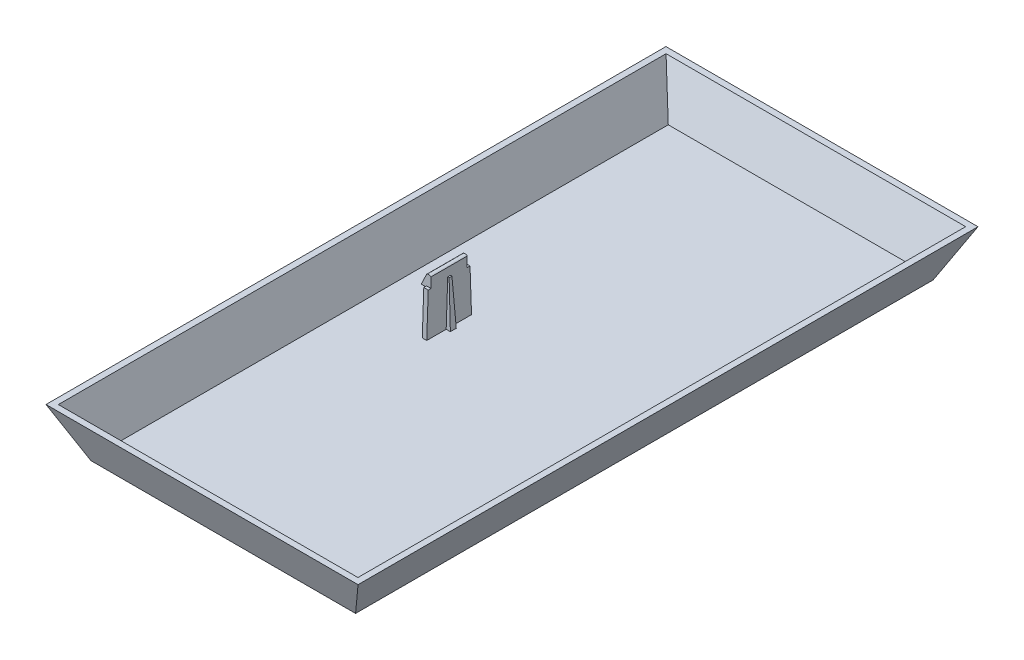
ISO-10303-21;
HEADER;
FILE_DESCRIPTION(('STEP AP214'),'2;1');
FILE_NAME('part.step','',(''),(''),'','','');
FILE_SCHEMA(('AUTOMOTIVE_DESIGN { 1 0 10303 214 1 1 1 1 }'));
ENDSEC;
DATA;
#1=APPLICATION_CONTEXT('core data for automotive mechanical design processes');
#2=APPLICATION_PROTOCOL_DEFINITION('international standard','automotive_design',2000,#1);
#3=PRODUCT_CONTEXT('',#1,'mechanical');
#4=PRODUCT('Part','Part','',(#3));
#5=PRODUCT_RELATED_PRODUCT_CATEGORY('part','',(#4));
#6=PRODUCT_DEFINITION_FORMATION('','',#4);
#7=PRODUCT_DEFINITION_CONTEXT('part definition',#1,'design');
#8=PRODUCT_DEFINITION('design','',#6,#7);
#9=PRODUCT_DEFINITION_SHAPE('','',#8);
#10=(LENGTH_UNIT() NAMED_UNIT(*) SI_UNIT(.MILLI.,.METRE.));
#11=(NAMED_UNIT(*) PLANE_ANGLE_UNIT() SI_UNIT($,.RADIAN.));
#12=(NAMED_UNIT(*) SI_UNIT($,.STERADIAN.) SOLID_ANGLE_UNIT());
#13=UNCERTAINTY_MEASURE_WITH_UNIT(LENGTH_MEASURE(1.E-05),#10,'distance_accuracy_value','');
#14=(GEOMETRIC_REPRESENTATION_CONTEXT(3) GLOBAL_UNCERTAINTY_ASSIGNED_CONTEXT((#13)) GLOBAL_UNIT_ASSIGNED_CONTEXT((#10,
#11,#12)) REPRESENTATION_CONTEXT('',''));
#15=CARTESIAN_POINT('',(0.,0.,0.));
#16=DIRECTION('',(0.,0.,1.));
#17=DIRECTION('',(1.,0.,0.));
#18=AXIS2_PLACEMENT_3D('',#15,#16,#17);
#19=CARTESIAN_POINT('',(-47.5,-15.,222.5));
#20=DIRECTION('',(0.,1.,0.));
#21=DIRECTION('',(0.,0.,1.));
#22=AXIS2_PLACEMENT_3D('',#19,#20,#21);
#23=PLANE('',#22);
#24=DIRECTION('',(-1.,0.,0.));
#25=VECTOR('',#24,1.);
#26=CARTESIAN_POINT('',(-47.5,-15.,8.90080269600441));
#27=LINE('',#26,#25);
#28=CARTESIAN_POINT('',(46.2639320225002,-15.,8.90080269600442));
#29=VERTEX_POINT('',#28);
#30=CARTESIAN_POINT('',(-46.2639320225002,-15.,8.90080269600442));
#31=VERTEX_POINT('',#30);
#32=EDGE_CURVE('E375',#29,#31,#27,.T.);
#33=ORIENTED_EDGE('',*,*,#32,.T.);
#34=DIRECTION('',(0.,0.,-1.));
#35=VECTOR('',#34,1.);
#36=CARTESIAN_POINT('',(-46.2639320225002,-15.,222.5));
#37=LINE('',#36,#35);
#38=CARTESIAN_POINT('',(-46.2639320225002,-15.,213.599197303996));
#39=VERTEX_POINT('',#38);
#40=EDGE_CURVE('E376',#39,#31,#37,.T.);
#41=ORIENTED_EDGE('',*,*,#40,.F.);
#42=DIRECTION('',(-1.,0.,0.));
#43=VECTOR('',#42,1.);
#44=CARTESIAN_POINT('',(-47.5,-15.,213.599197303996));
#45=LINE('',#44,#43);
#46=CARTESIAN_POINT('',(46.2639320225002,-15.,213.599197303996));
#47=VERTEX_POINT('',#46);
#48=EDGE_CURVE('E385',#47,#39,#45,.T.);
#49=ORIENTED_EDGE('',*,*,#48,.F.);
#50=DIRECTION('',(0.,0.,-1.));
#51=VECTOR('',#50,1.);
#52=CARTESIAN_POINT('',(46.2639320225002,-15.,222.5));
#53=LINE('',#52,#51);
#54=EDGE_CURVE('E380',#47,#29,#53,.T.);
#55=ORIENTED_EDGE('',*,*,#54,.T.);
#56=EDGE_LOOP('',(#33,#41,#49,#55));
#57=FACE_BOUND('',#56,.T.);
#58=DIRECTION('',(0.,0.,1.));
#59=VECTOR('',#58,1.);
#60=CARTESIAN_POINT('',(-25.6639320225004,-15.,110.75));
#61=LINE('',#60,#59);
#62=CARTESIAN_POINT('',(-25.6639320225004,-15.,110.191267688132));
#63=VERTEX_POINT('',#62);
#64=CARTESIAN_POINT('',(-25.6639320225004,-15.,112.308732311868));
#65=VERTEX_POINT('',#64);
#66=EDGE_CURVE('E275',#63,#65,#61,.T.);
#67=ORIENTED_EDGE('',*,*,#66,.F.);
#68=DIRECTION('',(1.,0.,0.));
#69=VECTOR('',#68,1.);
#70=CARTESIAN_POINT('',(-24.6639320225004,-15.,110.191267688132));
#71=LINE('',#70,#69);
#72=CARTESIAN_POINT('',(-24.1639320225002,-15.,110.191267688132));
#73=VERTEX_POINT('',#72);
#74=EDGE_CURVE('E75',#73,#63,#71,.F.);
#75=ORIENTED_EDGE('',*,*,#74,.F.);
#76=DIRECTION('',(0.,0.,1.));
#77=VECTOR('',#76,1.);
#78=CARTESIAN_POINT('',(-24.1639320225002,-15.,103.75));
#79=LINE('',#78,#77);
#80=CARTESIAN_POINT('',(-24.1639320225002,-15.,103.212220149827));
#81=VERTEX_POINT('',#80);
#82=EDGE_CURVE('E246',#81,#73,#79,.T.);
#83=ORIENTED_EDGE('',*,*,#82,.F.);
#84=DIRECTION('',(1.,0.,0.));
#85=VECTOR('',#84,1.);
#86=CARTESIAN_POINT('',(-24.1639320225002,-15.,103.212220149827));
#87=LINE('',#86,#85);
#88=CARTESIAN_POINT('',(-22.5639320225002,-15.,103.212220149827));
#89=VERTEX_POINT('',#88);
#90=EDGE_CURVE('E371',#89,#81,#87,.F.);
#91=ORIENTED_EDGE('',*,*,#90,.F.);
#92=DIRECTION('',(0.,0.,-1.));
#93=VECTOR('',#92,1.);
#94=CARTESIAN_POINT('',(-22.5639320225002,-15.,103.75));
#95=LINE('',#94,#93);
#96=CARTESIAN_POINT('',(-22.5639320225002,-15.,110.191267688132));
#97=VERTEX_POINT('',#96);
#98=EDGE_CURVE('E259',#97,#89,#95,.T.);
#99=ORIENTED_EDGE('',*,*,#98,.F.);
#100=DIRECTION('',(-1.,0.,0.));
#101=VECTOR('',#100,1.);
#102=CARTESIAN_POINT('',(-47.5,-15.,110.191267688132));
#103=LINE('',#102,#101);
#104=CARTESIAN_POINT('',(-21.0639320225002,-15.,110.191267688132));
#105=VERTEX_POINT('',#104);
#106=EDGE_CURVE('E451',#97,#105,#103,.F.);
#107=ORIENTED_EDGE('',*,*,#106,.T.);
#108=DIRECTION('',(0.,0.,1.));
#109=VECTOR('',#108,1.);
#110=CARTESIAN_POINT('',(-21.0639320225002,-15.,110.75));
#111=LINE('',#110,#109);
#112=CARTESIAN_POINT('',(-21.0639320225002,-15.,112.308732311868));
#113=VERTEX_POINT('',#112);
#114=EDGE_CURVE('E296',#105,#113,#111,.T.);
#115=ORIENTED_EDGE('',*,*,#114,.T.);
#116=DIRECTION('',(1.,0.,0.));
#117=VECTOR('',#116,1.);
#118=CARTESIAN_POINT('',(-47.5,-15.,112.308732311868));
#119=LINE('',#118,#117);
#120=CARTESIAN_POINT('',(-22.5639320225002,-15.,112.308732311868));
#121=VERTEX_POINT('',#120);
#122=EDGE_CURVE('E445',#121,#113,#119,.T.);
#123=ORIENTED_EDGE('',*,*,#122,.F.);
#124=CARTESIAN_POINT('',(-22.5639320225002,-15.,119.287779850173));
#125=VERTEX_POINT('',#124);
#126=EDGE_CURVE('E258',#125,#121,#95,.T.);
#127=ORIENTED_EDGE('',*,*,#126,.F.);
#128=DIRECTION('',(-1.,0.,0.));
#129=VECTOR('',#128,1.);
#130=CARTESIAN_POINT('',(-24.1639320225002,-15.,119.287779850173));
#131=LINE('',#130,#129);
#132=CARTESIAN_POINT('',(-24.1639320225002,-15.,119.287779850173));
#133=VERTEX_POINT('',#132);
#134=EDGE_CURVE('E252',#133,#125,#131,.F.);
#135=ORIENTED_EDGE('',*,*,#134,.F.);
#136=CARTESIAN_POINT('',(-24.1639320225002,-15.,112.308732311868));
#137=VERTEX_POINT('',#136);
#138=EDGE_CURVE('E236',#137,#133,#79,.T.);
#139=ORIENTED_EDGE('',*,*,#138,.F.);
#140=DIRECTION('',(-1.,0.,0.));
#141=VECTOR('',#140,1.);
#142=CARTESIAN_POINT('',(-24.6639320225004,-15.,112.308732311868));
#143=LINE('',#142,#141);
#144=EDGE_CURVE('E55',#137,#65,#143,.T.);
#145=ORIENTED_EDGE('',*,*,#144,.T.);
#146=EDGE_LOOP('',(#67,#75,#83,#91,#99,#107,#115,#123,#127,#135,#139,#145));
#147=FACE_BOUND('',#146,.T.);
#148=ADVANCED_FACE('F36',(#57,#147),#23,.T.);
#149=CARTESIAN_POINT('',(-24.1639320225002,3.99999999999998,103.75));
#150=DIRECTION('',(1.,0.,0.));
#151=DIRECTION('',(0.,0.,-1.));
#152=AXIS2_PLACEMENT_3D('',#149,#150,#151);
#153=PLANE('',#152);
#154=DIRECTION('',(0.,0.999390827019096,0.034899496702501));
#155=VECTOR('',#154,1.);
#156=CARTESIAN_POINT('',(-24.1639320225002,3.75219841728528,110.846108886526));
#157=LINE('',#156,#155);
#158=CARTESIAN_POINT('',(-24.1639320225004,0.999999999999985,110.75));
#159=VERTEX_POINT('',#158);
#160=EDGE_CURVE('E40',#159,#73,#157,.F.);
#161=ORIENTED_EDGE('',*,*,#160,.F.);
#162=DIRECTION('',(0.,0.,1.));
#163=VECTOR('',#162,1.);
#164=CARTESIAN_POINT('',(-24.1639320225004,0.999999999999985,110.75));
#165=LINE('',#164,#163);
#166=CARTESIAN_POINT('',(-24.1639320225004,0.999999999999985,111.75));
#167=VERTEX_POINT('',#166);
#168=EDGE_CURVE('E280',#159,#167,#165,.T.);
#169=ORIENTED_EDGE('',*,*,#168,.T.);
#170=DIRECTION('',(0.,-0.999390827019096,0.034899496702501));
#171=VECTOR('',#170,1.);
#172=CARTESIAN_POINT('',(-24.1639320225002,4.27537197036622,111.635621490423));
#173=LINE('',#172,#171);
#174=EDGE_CURVE('E243',#167,#137,#173,.T.);
#175=ORIENTED_EDGE('',*,*,#174,.T.);
#176=ORIENTED_EDGE('',*,*,#138,.T.);
#177=DIRECTION('',(0.,0.999390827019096,-0.034899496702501));
#178=VECTOR('',#177,1.);
#179=CARTESIAN_POINT('',(-24.1639320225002,0.399999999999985,118.75));
#180=LINE('',#179,#178);
#181=CARTESIAN_POINT('',(-24.1639320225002,0.399999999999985,118.75));
#182=VERTEX_POINT('',#181);
#183=EDGE_CURVE('E240',#182,#133,#180,.F.);
#184=ORIENTED_EDGE('',*,*,#183,.F.);
#185=DIRECTION('',(0.,0.,-1.));
#186=VECTOR('',#185,1.);
#187=CARTESIAN_POINT('',(-24.1639320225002,0.399999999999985,117.75));
#188=LINE('',#187,#186);
#189=CARTESIAN_POINT('',(-24.1639320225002,0.399999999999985,117.75));
#190=VERTEX_POINT('',#189);
#191=EDGE_CURVE('E344',#182,#190,#188,.T.);
#192=ORIENTED_EDGE('',*,*,#191,.T.);
#193=DIRECTION('',(0.,-1.,0.));
#194=VECTOR('',#193,1.);
#195=CARTESIAN_POINT('',(-24.1639320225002,3.99999999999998,117.75));
#196=LINE('',#195,#194);
#197=CARTESIAN_POINT('',(-24.1639320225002,0.,117.75));
#198=VERTEX_POINT('',#197);
#199=EDGE_CURVE('E341',#190,#198,#196,.T.);
#200=ORIENTED_EDGE('',*,*,#199,.T.);
#201=DIRECTION('',(0.,0.,1.));
#202=VECTOR('',#201,1.);
#203=CARTESIAN_POINT('',(-24.1639320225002,0.,99.3216820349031));
#204=LINE('',#203,#202);
#205=CARTESIAN_POINT('',(-24.1639320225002,0.,113.75));
#206=VERTEX_POINT('',#205);
#207=EDGE_CURVE('E359',#206,#198,#204,.T.);
#208=ORIENTED_EDGE('',*,*,#207,.F.);
#209=DIRECTION('',(0.,1.,0.));
#210=VECTOR('',#209,1.);
#211=CARTESIAN_POINT('',(-24.1639320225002,-4.00000000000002,113.75));
#212=LINE('',#211,#210);
#213=CARTESIAN_POINT('',(-24.1639320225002,3.99999999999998,113.75));
#214=VERTEX_POINT('',#213);
#215=EDGE_CURVE('E310',#206,#214,#212,.T.);
#216=ORIENTED_EDGE('',*,*,#215,.T.);
#217=DIRECTION('',(0.,0.,-1.));
#218=VECTOR('',#217,1.);
#219=CARTESIAN_POINT('',(-24.1639320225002,3.99999999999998,113.75));
#220=LINE('',#219,#218);
#221=CARTESIAN_POINT('',(-24.1639320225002,3.99999999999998,108.75));
#222=VERTEX_POINT('',#221);
#223=EDGE_CURVE('E305',#214,#222,#220,.T.);
#224=ORIENTED_EDGE('',*,*,#223,.T.);
#225=DIRECTION('',(0.,1.,0.));
#226=VECTOR('',#225,1.);
#227=CARTESIAN_POINT('',(-24.1639320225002,-4.00000000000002,108.75));
#228=LINE('',#227,#226);
#229=CARTESIAN_POINT('',(-24.1639320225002,0.,108.75));
#230=VERTEX_POINT('',#229);
#231=EDGE_CURVE('E311',#230,#222,#228,.T.);
#232=ORIENTED_EDGE('',*,*,#231,.F.);
#233=CARTESIAN_POINT('',(-24.1639320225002,0.,104.75));
#234=VERTEX_POINT('',#233);
#235=EDGE_CURVE('E247',#234,#230,#204,.T.);
#236=ORIENTED_EDGE('',*,*,#235,.F.);
#237=DIRECTION('',(0.,-1.,0.));
#238=VECTOR('',#237,1.);
#239=CARTESIAN_POINT('',(-24.1639320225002,3.99999999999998,104.75));
#240=LINE('',#239,#238);
#241=CARTESIAN_POINT('',(-24.1639320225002,0.399999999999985,104.75));
#242=VERTEX_POINT('',#241);
#243=EDGE_CURVE('E323',#242,#234,#240,.T.);
#244=ORIENTED_EDGE('',*,*,#243,.F.);
#245=DIRECTION('',(0.,0.,1.));
#246=VECTOR('',#245,1.);
#247=CARTESIAN_POINT('',(-24.1639320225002,0.399999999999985,104.75));
#248=LINE('',#247,#246);
#249=CARTESIAN_POINT('',(-24.1639320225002,0.399999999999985,103.75));
#250=VERTEX_POINT('',#249);
#251=EDGE_CURVE('E328',#250,#242,#248,.T.);
#252=ORIENTED_EDGE('',*,*,#251,.F.);
#253=DIRECTION('',(0.,0.999390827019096,0.034899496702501));
#254=VECTOR('',#253,1.);
#255=CARTESIAN_POINT('',(-24.1639320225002,3.99561529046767,103.875561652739));
#256=LINE('',#255,#254);
#257=EDGE_CURVE('E369',#250,#81,#256,.F.);
#258=ORIENTED_EDGE('',*,*,#257,.T.);
#259=ORIENTED_EDGE('',*,*,#82,.T.);
#260=EDGE_LOOP('',(#161,#169,#175,#176,#184,#192,#200,#208,#216,#224,#232,#236,#244,#252,#258,#259));
#261=FACE_BOUND('',#260,.T.);
#262=ADVANCED_FACE('F239',(#261),#153,.F.);
#263=CARTESIAN_POINT('',(-22.5639320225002,3.99999999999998,103.75));
#264=DIRECTION('',(-1.,0.,0.));
#265=DIRECTION('',(0.,0.,1.));
#266=AXIS2_PLACEMENT_3D('',#263,#264,#265);
#267=PLANE('',#266);
#268=DIRECTION('',(0.,0.999390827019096,0.034899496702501));
#269=VECTOR('',#268,1.);
#270=CARTESIAN_POINT('',(-22.5639320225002,0.999999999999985,110.75));
#271=LINE('',#270,#269);
#272=CARTESIAN_POINT('',(-22.5639320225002,0.999999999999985,110.75));
#273=VERTEX_POINT('',#272);
#274=EDGE_CURVE('E291',#273,#97,#271,.F.);
#275=ORIENTED_EDGE('',*,*,#274,.T.);
#276=ORIENTED_EDGE('',*,*,#98,.T.);
#277=DIRECTION('',(0.,0.999390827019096,0.034899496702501));
#278=VECTOR('',#277,1.);
#279=CARTESIAN_POINT('',(-22.5639320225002,0.399999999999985,103.75));
#280=LINE('',#279,#278);
#281=CARTESIAN_POINT('',(-22.5639320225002,0.399999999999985,103.75));
#282=VERTEX_POINT('',#281);
#283=EDGE_CURVE('E438',#282,#89,#280,.F.);
#284=ORIENTED_EDGE('',*,*,#283,.F.);
#285=DIRECTION('',(0.,0.,1.));
#286=VECTOR('',#285,1.);
#287=CARTESIAN_POINT('',(-22.5639320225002,0.399999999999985,103.75));
#288=LINE('',#287,#286);
#289=CARTESIAN_POINT('',(-22.5639320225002,0.399999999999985,104.75));
#290=VERTEX_POINT('',#289);
#291=EDGE_CURVE('E338',#282,#290,#288,.T.);
#292=ORIENTED_EDGE('',*,*,#291,.T.);
#293=DIRECTION('',(0.,-1.,0.));
#294=VECTOR('',#293,1.);
#295=CARTESIAN_POINT('',(-22.5639320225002,3.99999999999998,104.75));
#296=LINE('',#295,#294);
#297=CARTESIAN_POINT('',(-22.5639320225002,3.99999999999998,104.75));
#298=VERTEX_POINT('',#297);
#299=EDGE_CURVE('E334',#298,#290,#296,.T.);
#300=ORIENTED_EDGE('',*,*,#299,.F.);
#301=DIRECTION('',(0.,0.,-1.));
#302=VECTOR('',#301,1.);
#303=CARTESIAN_POINT('',(-22.5639320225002,3.99999999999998,103.75));
#304=LINE('',#303,#302);
#305=CARTESIAN_POINT('',(-22.5639320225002,3.99999999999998,117.75));
#306=VERTEX_POINT('',#305);
#307=EDGE_CURVE('E366',#306,#298,#304,.T.);
#308=ORIENTED_EDGE('',*,*,#307,.F.);
#309=DIRECTION('',(0.,-1.,0.));
#310=VECTOR('',#309,1.);
#311=CARTESIAN_POINT('',(-22.5639320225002,3.99999999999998,117.75));
#312=LINE('',#311,#310);
#313=CARTESIAN_POINT('',(-22.5639320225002,0.399999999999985,117.75));
#314=VERTEX_POINT('',#313);
#315=EDGE_CURVE('E352',#306,#314,#312,.T.);
#316=ORIENTED_EDGE('',*,*,#315,.T.);
#317=DIRECTION('',(0.,0.,1.));
#318=VECTOR('',#317,1.);
#319=CARTESIAN_POINT('',(-22.5639320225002,0.399999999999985,103.75));
#320=LINE('',#319,#318);
#321=CARTESIAN_POINT('',(-22.5639320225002,0.399999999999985,118.75));
#322=VERTEX_POINT('',#321);
#323=EDGE_CURVE('E46',#314,#322,#320,.T.);
#324=ORIENTED_EDGE('',*,*,#323,.T.);
#325=DIRECTION('',(0.,0.999390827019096,-0.034899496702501));
#326=VECTOR('',#325,1.);
#327=CARTESIAN_POINT('',(-22.5639320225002,4.51878884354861,118.606168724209));
#328=LINE('',#327,#326);
#329=EDGE_CURVE('E231',#322,#125,#328,.F.);
#330=ORIENTED_EDGE('',*,*,#329,.T.);
#331=ORIENTED_EDGE('',*,*,#126,.T.);
#332=DIRECTION('',(0.,-0.999390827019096,0.034899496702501));
#333=VECTOR('',#332,1.);
#334=CARTESIAN_POINT('',(-22.5639320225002,0.999999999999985,111.75));
#335=LINE('',#334,#333);
#336=CARTESIAN_POINT('',(-22.5639320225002,0.999999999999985,111.75));
#337=VERTEX_POINT('',#336);
#338=EDGE_CURVE('E287',#337,#121,#335,.T.);
#339=ORIENTED_EDGE('',*,*,#338,.F.);
#340=DIRECTION('',(0.,0.,1.));
#341=VECTOR('',#340,1.);
#342=CARTESIAN_POINT('',(-22.5639320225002,0.999999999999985,110.75));
#343=LINE('',#342,#341);
#344=EDGE_CURVE('E298',#273,#337,#343,.T.);
#345=ORIENTED_EDGE('',*,*,#344,.F.);
#346=EDGE_LOOP('',(#275,#276,#284,#292,#300,#308,#316,#324,#330,#331,#339,#345));
#347=FACE_BOUND('',#346,.T.);
#348=ADVANCED_FACE('F468',(#347),#267,.F.);
#349=CARTESIAN_POINT('',(-24.1639320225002,3.99999999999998,99.3216820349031));
#350=DIRECTION('',(-0.90327750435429,0.429056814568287,0.));
#351=DIRECTION('',(-0.429056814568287,-0.90327750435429,0.));
#352=AXIS2_PLACEMENT_3D('',#349,#350,#351);
#353=PLANE('',#352);
#354=DIRECTION('',(-0.429056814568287,-0.90327750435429,0.));
#355=VECTOR('',#354,1.);
#356=CARTESIAN_POINT('',(-24.1639320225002,3.99999999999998,108.75));
#357=LINE('',#356,#355);
#358=CARTESIAN_POINT('',(-26.0639320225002,0.,108.75));
#359=VERTEX_POINT('',#358);
#360=EDGE_CURVE('E321',#222,#359,#357,.T.);
#361=ORIENTED_EDGE('',*,*,#360,.F.);
#362=DIRECTION('',(0.,0.,1.));
#363=VECTOR('',#362,1.);
#364=CARTESIAN_POINT('',(-24.1639320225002,3.99999999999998,103.75));
#365=LINE('',#364,#363);
#366=CARTESIAN_POINT('',(-24.1639320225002,3.99999999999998,104.75));
#367=VERTEX_POINT('',#366);
#368=EDGE_CURVE('E363',#367,#222,#365,.T.);
#369=ORIENTED_EDGE('',*,*,#368,.F.);
#370=DIRECTION('',(-0.429056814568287,-0.90327750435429,0.));
#371=VECTOR('',#370,1.);
#372=CARTESIAN_POINT('',(-24.1639320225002,3.99999999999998,104.75));
#373=LINE('',#372,#371);
#374=CARTESIAN_POINT('',(-26.0639320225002,0.,104.75));
#375=VERTEX_POINT('',#374);
#376=EDGE_CURVE('E336',#367,#375,#373,.T.);
#377=ORIENTED_EDGE('',*,*,#376,.T.);
#378=DIRECTION('',(0.,0.,1.));
#379=VECTOR('',#378,1.);
#380=CARTESIAN_POINT('',(-26.0639320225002,0.,99.3216820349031));
#381=LINE('',#380,#379);
#382=EDGE_CURVE('E360',#375,#359,#381,.T.);
#383=ORIENTED_EDGE('',*,*,#382,.T.);
#384=EDGE_LOOP('',(#361,#369,#377,#383));
#385=FACE_BOUND('',#384,.T.);
#386=ADVANCED_FACE('F592',(#385),#353,.T.);
#387=CARTESIAN_POINT('',(-26.0639320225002,0.,99.3216820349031));
#388=DIRECTION('',(0.,-1.,0.));
#389=DIRECTION('',(0.,0.,-1.));
#390=AXIS2_PLACEMENT_3D('',#387,#388,#389);
#391=PLANE('',#390);
#392=DIRECTION('',(1.,0.,0.));
#393=VECTOR('',#392,1.);
#394=CARTESIAN_POINT('',(-26.0639320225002,0.,108.75));
#395=LINE('',#394,#393);
#396=EDGE_CURVE('E319',#359,#230,#395,.T.);
#397=ORIENTED_EDGE('',*,*,#396,.F.);
#398=ORIENTED_EDGE('',*,*,#382,.F.);
#399=DIRECTION('',(-1.,0.,0.));
#400=VECTOR('',#399,1.);
#401=CARTESIAN_POINT('',(-26.0639320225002,0.,104.75));
#402=LINE('',#401,#400);
#403=EDGE_CURVE('E325',#234,#375,#402,.T.);
#404=ORIENTED_EDGE('',*,*,#403,.F.);
#405=ORIENTED_EDGE('',*,*,#235,.T.);
#406=EDGE_LOOP('',(#397,#398,#404,#405));
#407=FACE_BOUND('',#406,.T.);
#408=ADVANCED_FACE('F588',(#407),#391,.T.);
#409=DIRECTION('',(0.429056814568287,0.90327750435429,0.));
#410=VECTOR('',#409,1.);
#411=CARTESIAN_POINT('',(-24.1639320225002,3.99999999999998,113.75));
#412=LINE('',#411,#410);
#413=CARTESIAN_POINT('',(-26.0639320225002,0.,113.75));
#414=VERTEX_POINT('',#413);
#415=EDGE_CURVE('E317',#414,#214,#412,.T.);
#416=ORIENTED_EDGE('',*,*,#415,.F.);
#417=CARTESIAN_POINT('',(-26.0639320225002,0.,117.75));
#418=VERTEX_POINT('',#417);
#419=EDGE_CURVE('E356',#414,#418,#381,.T.);
#420=ORIENTED_EDGE('',*,*,#419,.T.);
#421=DIRECTION('',(-0.429056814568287,-0.90327750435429,0.));
#422=VECTOR('',#421,1.);
#423=CARTESIAN_POINT('',(-24.1639320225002,3.99999999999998,117.75));
#424=LINE('',#423,#422);
#425=CARTESIAN_POINT('',(-24.1639320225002,3.99999999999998,117.75));
#426=VERTEX_POINT('',#425);
#427=EDGE_CURVE('E433',#426,#418,#424,.T.);
#428=ORIENTED_EDGE('',*,*,#427,.F.);
#429=EDGE_CURVE('E367',#214,#426,#365,.T.);
#430=ORIENTED_EDGE('',*,*,#429,.F.);
#431=EDGE_LOOP('',(#416,#420,#428,#430));
#432=FACE_BOUND('',#431,.T.);
#433=ADVANCED_FACE('F507',(#432),#353,.T.);
#434=CARTESIAN_POINT('',(-24.1639320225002,0.399999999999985,103.75));
#435=DIRECTION('',(0.,0.034899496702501,-0.999390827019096));
#436=DIRECTION('',(0.,0.999390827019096,0.034899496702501));
#437=AXIS2_PLACEMENT_3D('',#434,#435,#436);
#438=PLANE('',#437);
#439=ORIENTED_EDGE('',*,*,#257,.F.);
#440=DIRECTION('',(1.,0.,0.));
#441=VECTOR('',#440,1.);
#442=CARTESIAN_POINT('',(-24.1639320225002,0.399999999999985,103.75));
#443=LINE('',#442,#441);
#444=EDGE_CURVE('E11',#250,#282,#443,.T.);
#445=ORIENTED_EDGE('',*,*,#444,.T.);
#446=ORIENTED_EDGE('',*,*,#283,.T.);
#447=ORIENTED_EDGE('',*,*,#90,.T.);
#448=EDGE_LOOP('',(#439,#445,#446,#447));
#449=FACE_BOUND('',#448,.T.);
#450=ADVANCED_FACE('F474',(#449),#438,.T.);
#451=CARTESIAN_POINT('',(-24.1639320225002,0.399999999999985,118.75));
#452=DIRECTION('',(0.,0.034899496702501,0.999390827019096));
#453=DIRECTION('',(0.,-0.999390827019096,0.034899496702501));
#454=AXIS2_PLACEMENT_3D('',#451,#452,#453);
#455=PLANE('',#454);
#456=DIRECTION('',(-1.,0.,0.));
#457=VECTOR('',#456,1.);
#458=CARTESIAN_POINT('',(-24.1639320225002,0.399999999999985,118.75));
#459=LINE('',#458,#457);
#460=EDGE_CURVE('E254',#322,#182,#459,.T.);
#461=ORIENTED_EDGE('',*,*,#460,.T.);
#462=ORIENTED_EDGE('',*,*,#183,.T.);
#463=ORIENTED_EDGE('',*,*,#134,.T.);
#464=ORIENTED_EDGE('',*,*,#329,.F.);
#465=EDGE_LOOP('',(#461,#462,#463,#464));
#466=FACE_BOUND('',#465,.T.);
#467=ADVANCED_FACE('F251',(#466),#455,.T.);
#468=DIRECTION('',(-1.,0.,0.));
#469=VECTOR('',#468,1.);
#470=CARTESIAN_POINT('',(-26.0639320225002,0.,113.75));
#471=LINE('',#470,#469);
#472=EDGE_CURVE('E313',#206,#414,#471,.T.);
#473=ORIENTED_EDGE('',*,*,#472,.F.);
#474=ORIENTED_EDGE('',*,*,#207,.T.);
#475=DIRECTION('',(-1.,0.,0.));
#476=VECTOR('',#475,1.);
#477=CARTESIAN_POINT('',(-26.0639320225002,0.,117.75));
#478=LINE('',#477,#476);
#479=EDGE_CURVE('E346',#198,#418,#478,.T.);
#480=ORIENTED_EDGE('',*,*,#479,.T.);
#481=ORIENTED_EDGE('',*,*,#419,.F.);
#482=EDGE_LOOP('',(#473,#474,#480,#481));
#483=FACE_BOUND('',#482,.T.);
#484=ADVANCED_FACE('F503',(#483),#391,.T.);
#485=CARTESIAN_POINT('',(-25.5077569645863,0.399999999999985,117.75));
#486=DIRECTION('',(0.,-1.,0.));
#487=DIRECTION('',(0.,0.,-1.));
#488=AXIS2_PLACEMENT_3D('',#485,#486,#487);
#489=PLANE('',#488);
#490=ORIENTED_EDGE('',*,*,#191,.F.);
#491=ORIENTED_EDGE('',*,*,#460,.F.);
#492=ORIENTED_EDGE('',*,*,#323,.F.);
#493=DIRECTION('',(-1.,0.,0.));
#494=VECTOR('',#493,1.);
#495=CARTESIAN_POINT('',(-25.5077569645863,0.399999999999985,117.75));
#496=LINE('',#495,#494);
#497=EDGE_CURVE('E349',#314,#190,#496,.T.);
#498=ORIENTED_EDGE('',*,*,#497,.T.);
#499=EDGE_LOOP('',(#490,#491,#492,#498));
#500=FACE_BOUND('',#499,.T.);
#501=ADVANCED_FACE('F498',(#500),#489,.F.);
#502=CARTESIAN_POINT('',(56.,0.,222.5));
#503=DIRECTION('',(0.,-1.,0.));
#504=DIRECTION('',(0.,0.,-1.));
#505=AXIS2_PLACEMENT_3D('',#502,#503,#504);
#506=PLANE('',#505);
#507=DIRECTION('',(-1.,0.,0.));
#508=VECTOR('',#507,1.);
#509=CARTESIAN_POINT('',(56.,0.,0.));
#510=LINE('',#509,#508);
#511=CARTESIAN_POINT('',(56.0000000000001,0.,0.));
#512=VERTEX_POINT('',#511);
#513=CARTESIAN_POINT('',(-56.,0.,0.));
#514=VERTEX_POINT('',#513);
#515=EDGE_CURVE('E415',#512,#514,#510,.T.);
#516=ORIENTED_EDGE('',*,*,#515,.T.);
#517=DIRECTION('',(0.,0.,-1.));
#518=VECTOR('',#517,1.);
#519=CARTESIAN_POINT('',(-56.,0.,222.5));
#520=LINE('',#519,#518);
#521=CARTESIAN_POINT('',(-55.9999999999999,0.,222.5));
#522=VERTEX_POINT('',#521);
#523=EDGE_CURVE('E419',#522,#514,#520,.T.);
#524=ORIENTED_EDGE('',*,*,#523,.F.);
#525=DIRECTION('',(-1.,0.,0.));
#526=VECTOR('',#525,1.);
#527=CARTESIAN_POINT('',(56.,0.,222.5));
#528=LINE('',#527,#526);
#529=CARTESIAN_POINT('',(56.,0.,222.5));
#530=VERTEX_POINT('',#529);
#531=EDGE_CURVE('E416',#530,#522,#528,.T.);
#532=ORIENTED_EDGE('',*,*,#531,.F.);
#533=DIRECTION('',(0.,0.,-1.));
#534=VECTOR('',#533,1.);
#535=CARTESIAN_POINT('',(56.,0.,222.5));
#536=LINE('',#535,#534);
#537=EDGE_CURVE('E424',#530,#512,#536,.T.);
#538=ORIENTED_EDGE('',*,*,#537,.T.);
#539=EDGE_LOOP('',(#516,#524,#532,#538));
#540=FACE_BOUND('',#539,.T.);
#541=DIRECTION('',(-1.,0.,0.));
#542=VECTOR('',#541,1.);
#543=CARTESIAN_POINT('',(371.47286626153,0.,2.19097843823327));
#544=LINE('',#543,#542);
#545=CARTESIAN_POINT('',(53.7639320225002,0.,2.19097843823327));
#546=VERTEX_POINT('',#545);
#547=CARTESIAN_POINT('',(-53.7639320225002,0.,2.19097843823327));
#548=VERTEX_POINT('',#547);
#549=EDGE_CURVE('E384',#546,#548,#544,.T.);
#550=ORIENTED_EDGE('',*,*,#549,.F.);
#551=DIRECTION('',(0.,0.,-1.));
#552=VECTOR('',#551,1.);
#553=CARTESIAN_POINT('',(53.7639320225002,0.,222.5));
#554=LINE('',#553,#552);
#555=CARTESIAN_POINT('',(53.7639320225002,0.,220.309021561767));
#556=VERTEX_POINT('',#555);
#557=EDGE_CURVE('E389',#556,#546,#554,.T.);
#558=ORIENTED_EDGE('',*,*,#557,.F.);
#559=DIRECTION('',(-1.,0.,0.));
#560=VECTOR('',#559,1.);
#561=CARTESIAN_POINT('',(371.47286626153,0.,220.309021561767));
#562=LINE('',#561,#560);
#563=CARTESIAN_POINT('',(-53.7639320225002,0.,220.309021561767));
#564=VERTEX_POINT('',#563);
#565=EDGE_CURVE('E396',#556,#564,#562,.T.);
#566=ORIENTED_EDGE('',*,*,#565,.T.);
#567=DIRECTION('',(0.,0.,-1.));
#568=VECTOR('',#567,1.);
#569=CARTESIAN_POINT('',(-53.7639320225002,0.,222.5));
#570=LINE('',#569,#568);
#571=EDGE_CURVE('E393',#564,#548,#570,.T.);
#572=ORIENTED_EDGE('',*,*,#571,.T.);
#573=EDGE_LOOP('',(#550,#558,#566,#572));
#574=FACE_BOUND('',#573,.T.);
#575=ADVANCED_FACE('F552',(#540,#574),#506,.F.);
#576=CARTESIAN_POINT('',(-56.,0.,222.5));
#577=DIRECTION('',(0.894427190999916,0.447213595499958,0.));
#578=DIRECTION('',(-0.447213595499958,0.894427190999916,0.));
#579=AXIS2_PLACEMENT_3D('',#576,#577,#578);
#580=PLANE('',#579);
#581=DIRECTION('',(-0.415213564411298,0.830427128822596,-0.371468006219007));
#582=VECTOR('',#581,1.);
#583=CARTESIAN_POINT('',(-21.6819215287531,-68.6361569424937,30.7024367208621));
#584=LINE('',#583,#582);
#585=CARTESIAN_POINT('',(-47.5,-17.,7.60446749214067));
#586=VERTEX_POINT('',#585);
#587=EDGE_CURVE('E406',#586,#514,#584,.T.);
#588=ORIENTED_EDGE('',*,*,#587,.F.);
#589=DIRECTION('',(0.,0.,-1.));
#590=VECTOR('',#589,1.);
#591=CARTESIAN_POINT('',(-47.5,-17.,222.5));
#592=LINE('',#591,#590);
#593=CARTESIAN_POINT('',(-47.5,-17.,214.89553250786));
#594=VERTEX_POINT('',#593);
#595=EDGE_CURVE('E430',#594,#586,#592,.T.);
#596=ORIENTED_EDGE('',*,*,#595,.F.);
#597=DIRECTION('',(-0.415213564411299,0.830427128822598,0.371468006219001));
#598=VECTOR('',#597,1.);
#599=CARTESIAN_POINT('',(-56.,0.,222.5));
#600=LINE('',#599,#598);
#601=EDGE_CURVE('E412',#594,#522,#600,.T.);
#602=ORIENTED_EDGE('',*,*,#601,.T.);
#603=ORIENTED_EDGE('',*,*,#523,.T.);
#604=EDGE_LOOP('',(#588,#596,#602,#603));
#605=FACE_BOUND('',#604,.T.);
#606=ADVANCED_FACE('F555',(#605),#580,.F.);
#607=CARTESIAN_POINT('',(-47.5,-17.,222.5));
#608=DIRECTION('',(0.,1.,0.));
#609=DIRECTION('',(0.,0.,1.));
#610=AXIS2_PLACEMENT_3D('',#607,#608,#609);
#611=PLANE('',#610);
#612=DIRECTION('',(-1.,0.,0.));
#613=VECTOR('',#612,1.);
#614=CARTESIAN_POINT('',(-47.5,-17.,7.60446749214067));
#615=LINE('',#614,#613);
#616=CARTESIAN_POINT('',(47.5,-17.,7.60446749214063));
#617=VERTEX_POINT('',#616);
#618=EDGE_CURVE('E404',#617,#586,#615,.T.);
#619=ORIENTED_EDGE('',*,*,#618,.F.);
#620=DIRECTION('',(0.,0.,-1.));
#621=VECTOR('',#620,1.);
#622=CARTESIAN_POINT('',(47.5,-17.,222.5));
#623=LINE('',#622,#621);
#624=CARTESIAN_POINT('',(47.5,-17.,214.89553250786));
#625=VERTEX_POINT('',#624);
#626=EDGE_CURVE('E427',#625,#617,#623,.T.);
#627=ORIENTED_EDGE('',*,*,#626,.F.);
#628=DIRECTION('',(-1.,0.,0.));
#629=VECTOR('',#628,1.);
#630=CARTESIAN_POINT('',(-47.5,-17.,214.89553250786));
#631=LINE('',#630,#629);
#632=EDGE_CURVE('E410',#625,#594,#631,.T.);
#633=ORIENTED_EDGE('',*,*,#632,.T.);
#634=ORIENTED_EDGE('',*,*,#595,.T.);
#635=EDGE_LOOP('',(#619,#627,#633,#634));
#636=FACE_BOUND('',#635,.T.);
#637=ADVANCED_FACE('F559',(#636),#611,.F.);
#638=CARTESIAN_POINT('',(56.,0.,222.5));
#639=DIRECTION('',(-0.894427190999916,0.447213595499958,0.));
#640=DIRECTION('',(-0.447213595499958,-0.894427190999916,0.));
#641=AXIS2_PLACEMENT_3D('',#638,#639,#640);
#642=PLANE('',#641);
#643=DIRECTION('',(-0.415213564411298,-0.830427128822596,0.371468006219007));
#644=VECTOR('',#643,1.);
#645=CARTESIAN_POINT('',(21.6819215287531,-68.6361569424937,30.7024367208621));
#646=LINE('',#645,#644);
#647=EDGE_CURVE('E379',#512,#617,#646,.T.);
#648=ORIENTED_EDGE('',*,*,#647,.F.);
#649=ORIENTED_EDGE('',*,*,#537,.F.);
#650=DIRECTION('',(-0.415213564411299,-0.830427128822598,-0.371468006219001));
#651=VECTOR('',#650,1.);
#652=CARTESIAN_POINT('',(56.,0.,222.5));
#653=LINE('',#652,#651);
#654=EDGE_CURVE('E408',#530,#625,#653,.T.);
#655=ORIENTED_EDGE('',*,*,#654,.T.);
#656=ORIENTED_EDGE('',*,*,#626,.T.);
#657=EDGE_LOOP('',(#648,#649,#655,#656));
#658=FACE_BOUND('',#657,.T.);
#659=ADVANCED_FACE('F550',(#658),#642,.F.);
#660=CARTESIAN_POINT('',(371.47286626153,0.,222.5));
#661=DIRECTION('',(0.,0.408330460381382,-0.912834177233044));
#662=DIRECTION('',(0.,0.912834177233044,0.408330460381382));
#663=AXIS2_PLACEMENT_3D('',#660,#661,#662);
#664=PLANE('',#663);
#665=ORIENTED_EDGE('',*,*,#601,.F.);
#666=ORIENTED_EDGE('',*,*,#632,.F.);
#667=ORIENTED_EDGE('',*,*,#654,.F.);
#668=ORIENTED_EDGE('',*,*,#531,.T.);
#669=EDGE_LOOP('',(#665,#666,#667,#668));
#670=FACE_BOUND('',#669,.T.);
#671=ADVANCED_FACE('F546',(#670),#664,.F.);
#672=CARTESIAN_POINT('',(371.47286626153,0.,0.));
#673=DIRECTION('',(0.,-0.408330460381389,-0.912834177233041));
#674=DIRECTION('',(0.,0.912834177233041,-0.408330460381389));
#675=AXIS2_PLACEMENT_3D('',#672,#673,#674);
#676=PLANE('',#675);
#677=ORIENTED_EDGE('',*,*,#618,.T.);
#678=ORIENTED_EDGE('',*,*,#587,.T.);
#679=ORIENTED_EDGE('',*,*,#515,.F.);
#680=ORIENTED_EDGE('',*,*,#647,.T.);
#681=EDGE_LOOP('',(#677,#678,#679,#680));
#682=FACE_BOUND('',#681,.T.);
#683=ADVANCED_FACE('F543',(#682),#676,.T.);
#684=CARTESIAN_POINT('',(-54.2111456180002,0.894427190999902,222.5));
#685=DIRECTION('',(0.894427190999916,0.447213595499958,0.));
#686=DIRECTION('',(-0.447213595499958,0.894427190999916,0.));
#687=AXIS2_PLACEMENT_3D('',#684,#685,#686);
#688=PLANE('',#687);
#689=DIRECTION('',(-0.415213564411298,0.830427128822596,-0.371468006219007));
#690=VECTOR('',#689,1.);
#691=CARTESIAN_POINT('',(-20.1692901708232,-67.189283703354,32.2461974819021));
#692=LINE('',#691,#690);
#693=EDGE_CURVE('E372',#31,#548,#692,.T.);
#694=ORIENTED_EDGE('',*,*,#693,.T.);
#695=ORIENTED_EDGE('',*,*,#571,.F.);
#696=DIRECTION('',(-0.415213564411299,0.830427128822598,0.371468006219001));
#697=VECTOR('',#696,1.);
#698=CARTESIAN_POINT('',(-54.4873686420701,1.4468732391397,220.95623923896));
#699=LINE('',#698,#697);
#700=EDGE_CURVE('E381',#39,#564,#699,.T.);
#701=ORIENTED_EDGE('',*,*,#700,.F.);
#702=ORIENTED_EDGE('',*,*,#40,.T.);
#703=EDGE_LOOP('',(#694,#695,#701,#702));
#704=FACE_BOUND('',#703,.T.);
#705=ADVANCED_FACE('F530',(#704),#688,.T.);
#706=CARTESIAN_POINT('',(54.2111456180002,0.894427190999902,222.5));
#707=DIRECTION('',(-0.894427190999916,0.447213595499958,0.));
#708=DIRECTION('',(-0.447213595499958,-0.894427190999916,0.));
#709=AXIS2_PLACEMENT_3D('',#706,#707,#708);
#710=PLANE('',#709);
#711=DIRECTION('',(-0.415213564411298,-0.830427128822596,0.371468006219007));
#712=VECTOR('',#711,1.);
#713=CARTESIAN_POINT('',(20.1692901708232,-67.189283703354,32.2461974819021));
#714=LINE('',#713,#712);
#715=EDGE_CURVE('E255',#546,#29,#714,.T.);
#716=ORIENTED_EDGE('',*,*,#715,.T.);
#717=ORIENTED_EDGE('',*,*,#54,.F.);
#718=DIRECTION('',(-0.415213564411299,-0.830427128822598,-0.371468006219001));
#719=VECTOR('',#718,1.);
#720=CARTESIAN_POINT('',(54.4873686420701,1.4468732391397,220.95623923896));
#721=LINE('',#720,#719);
#722=EDGE_CURVE('E374',#556,#47,#721,.T.);
#723=ORIENTED_EDGE('',*,*,#722,.F.);
#724=ORIENTED_EDGE('',*,*,#557,.T.);
#725=EDGE_LOOP('',(#716,#717,#723,#724));
#726=FACE_BOUND('',#725,.T.);
#727=ADVANCED_FACE('F531',(#726),#710,.T.);
#728=CARTESIAN_POINT('',(371.47286626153,0.816660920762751,220.674331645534));
#729=DIRECTION('',(0.,0.408330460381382,-0.912834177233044));
#730=DIRECTION('',(0.,0.912834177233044,0.408330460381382));
#731=AXIS2_PLACEMENT_3D('',#728,#729,#730);
#732=PLANE('',#731);
#733=ORIENTED_EDGE('',*,*,#700,.T.);
#734=ORIENTED_EDGE('',*,*,#565,.F.);
#735=ORIENTED_EDGE('',*,*,#722,.T.);
#736=ORIENTED_EDGE('',*,*,#48,.T.);
#737=EDGE_LOOP('',(#733,#734,#735,#736));
#738=FACE_BOUND('',#737,.T.);
#739=ADVANCED_FACE('F534',(#738),#732,.T.);
#740=CARTESIAN_POINT('',(371.47286626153,0.816660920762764,1.82566835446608));
#741=DIRECTION('',(0.,-0.408330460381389,-0.912834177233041));
#742=DIRECTION('',(0.,0.912834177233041,-0.408330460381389));
#743=AXIS2_PLACEMENT_3D('',#740,#741,#742);
#744=PLANE('',#743);
#745=ORIENTED_EDGE('',*,*,#32,.F.);
#746=ORIENTED_EDGE('',*,*,#715,.F.);
#747=ORIENTED_EDGE('',*,*,#549,.T.);
#748=ORIENTED_EDGE('',*,*,#693,.F.);
#749=EDGE_LOOP('',(#745,#746,#747,#748));
#750=FACE_BOUND('',#749,.T.);
#751=ADVANCED_FACE('F538',(#750),#744,.F.);
#752=CARTESIAN_POINT('',(-25.5077569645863,0.399999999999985,117.75));
#753=DIRECTION('',(0.,0.,-1.));
#754=DIRECTION('',(-1.,0.,0.));
#755=AXIS2_PLACEMENT_3D('',#752,#753,#754);
#756=PLANE('',#755);
#757=ORIENTED_EDGE('',*,*,#199,.F.);
#758=ORIENTED_EDGE('',*,*,#497,.F.);
#759=ORIENTED_EDGE('',*,*,#315,.F.);
#760=CARTESIAN_POINT('',(-23.3639320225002,3.19999999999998,117.75));
#761=DIRECTION('',(0.,0.,-1.));
#762=DIRECTION('',(-1.,0.,0.));
#763=AXIS2_PLACEMENT_3D('',#760,#761,#762);
#764=CIRCLE('',#763,1.13137084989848);
#765=EDGE_CURVE('E302',#306,#426,#764,.F.);
#766=ORIENTED_EDGE('',*,*,#765,.T.);
#767=ORIENTED_EDGE('',*,*,#427,.T.);
#768=ORIENTED_EDGE('',*,*,#479,.F.);
#769=EDGE_LOOP('',(#757,#758,#759,#766,#767,#768));
#770=FACE_BOUND('',#769,.T.);
#771=ADVANCED_FACE('F495',(#770),#756,.F.);
#772=CARTESIAN_POINT('',(-25.5077569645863,0.399999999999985,104.75));
#773=DIRECTION('',(0.,-1.,0.));
#774=DIRECTION('',(0.,0.,1.));
#775=AXIS2_PLACEMENT_3D('',#772,#773,#774);
#776=PLANE('',#775);
#777=ORIENTED_EDGE('',*,*,#444,.F.);
#778=ORIENTED_EDGE('',*,*,#251,.T.);
#779=DIRECTION('',(-1.,0.,0.));
#780=VECTOR('',#779,1.);
#781=CARTESIAN_POINT('',(-25.5077569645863,0.399999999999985,104.75));
#782=LINE('',#781,#780);
#783=EDGE_CURVE('E331',#290,#242,#782,.T.);
#784=ORIENTED_EDGE('',*,*,#783,.F.);
#785=ORIENTED_EDGE('',*,*,#291,.F.);
#786=EDGE_LOOP('',(#777,#778,#784,#785));
#787=FACE_BOUND('',#786,.T.);
#788=ADVANCED_FACE('F481',(#787),#776,.F.);
#789=CARTESIAN_POINT('',(-25.5077569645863,0.399999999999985,104.75));
#790=DIRECTION('',(0.,0.,-1.));
#791=DIRECTION('',(-1.,0.,0.));
#792=AXIS2_PLACEMENT_3D('',#789,#790,#791);
#793=PLANE('',#792);
#794=ORIENTED_EDGE('',*,*,#783,.T.);
#795=ORIENTED_EDGE('',*,*,#243,.T.);
#796=ORIENTED_EDGE('',*,*,#403,.T.);
#797=ORIENTED_EDGE('',*,*,#376,.F.);
#798=CARTESIAN_POINT('',(-23.3639320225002,3.19999999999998,104.75));
#799=DIRECTION('',(0.,0.,-1.));
#800=DIRECTION('',(1.,0.,0.));
#801=AXIS2_PLACEMENT_3D('',#798,#799,#800);
#802=CIRCLE('',#801,1.13137084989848);
#803=EDGE_CURVE('E295',#367,#298,#802,.T.);
#804=ORIENTED_EDGE('',*,*,#803,.T.);
#805=ORIENTED_EDGE('',*,*,#299,.T.);
#806=EDGE_LOOP('',(#794,#795,#796,#797,#804,#805));
#807=FACE_BOUND('',#806,.T.);
#808=ADVANCED_FACE('F483',(#807),#793,.T.);
#809=CARTESIAN_POINT('',(-29.0440642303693,-4.00000000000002,108.75));
#810=DIRECTION('',(0.,0.,-1.));
#811=DIRECTION('',(-1.,0.,0.));
#812=AXIS2_PLACEMENT_3D('',#809,#810,#811);
#813=PLANE('',#812);
#814=ORIENTED_EDGE('',*,*,#360,.T.);
#815=ORIENTED_EDGE('',*,*,#396,.T.);
#816=ORIENTED_EDGE('',*,*,#231,.T.);
#817=EDGE_LOOP('',(#814,#815,#816));
#818=FACE_BOUND('',#817,.T.);
#819=ADVANCED_FACE('F511',(#818),#813,.F.);
#820=CARTESIAN_POINT('',(-29.0440642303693,-4.00000000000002,113.75));
#821=DIRECTION('',(0.,0.,1.));
#822=DIRECTION('',(1.,0.,0.));
#823=AXIS2_PLACEMENT_3D('',#820,#821,#822);
#824=PLANE('',#823);
#825=ORIENTED_EDGE('',*,*,#415,.T.);
#826=ORIENTED_EDGE('',*,*,#215,.F.);
#827=ORIENTED_EDGE('',*,*,#472,.T.);
#828=EDGE_LOOP('',(#825,#826,#827));
#829=FACE_BOUND('',#828,.T.);
#830=ADVANCED_FACE('F509',(#829),#824,.F.);
#831=CARTESIAN_POINT('',(-23.3639320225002,3.19999999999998,119.383954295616));
#832=DIRECTION('',(0.,0.,-1.));
#833=DIRECTION('',(-1.,0.,0.));
#834=AXIS2_PLACEMENT_3D('',#831,#832,#833);
#835=CYLINDRICAL_SURFACE('',#834,1.13137084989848);
#836=ORIENTED_EDGE('',*,*,#765,.F.);
#837=ORIENTED_EDGE('',*,*,#307,.T.);
#838=ORIENTED_EDGE('',*,*,#803,.F.);
#839=ORIENTED_EDGE('',*,*,#368,.T.);
#840=ORIENTED_EDGE('',*,*,#223,.F.);
#841=ORIENTED_EDGE('',*,*,#429,.T.);
#842=EDGE_LOOP('',(#836,#837,#838,#839,#840,#841));
#843=FACE_BOUND('',#842,.T.);
#844=ADVANCED_FACE('F489',(#843),#835,.T.);
#845=CARTESIAN_POINT('',(-22.0639320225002,0.999999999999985,110.75));
#846=DIRECTION('',(0.,1.,0.));
#847=DIRECTION('',(0.,0.,1.));
#848=AXIS2_PLACEMENT_3D('',#845,#846,#847);
#849=PLANE('',#848);
#850=ORIENTED_EDGE('',*,*,#344,.T.);
#851=DIRECTION('',(-1.,0.,0.));
#852=VECTOR('',#851,1.);
#853=CARTESIAN_POINT('',(-22.0639320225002,0.999999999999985,111.75));
#854=LINE('',#853,#852);
#855=CARTESIAN_POINT('',(-22.0639320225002,0.999999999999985,111.75));
#856=VERTEX_POINT('',#855);
#857=EDGE_CURVE('E284',#856,#337,#854,.T.);
#858=ORIENTED_EDGE('',*,*,#857,.F.);
#859=DIRECTION('',(0.,0.,1.));
#860=VECTOR('',#859,1.);
#861=CARTESIAN_POINT('',(-22.0639320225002,0.999999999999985,110.75));
#862=LINE('',#861,#860);
#863=CARTESIAN_POINT('',(-22.0639320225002,0.999999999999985,110.75));
#864=VERTEX_POINT('',#863);
#865=EDGE_CURVE('E293',#864,#856,#862,.T.);
#866=ORIENTED_EDGE('',*,*,#865,.F.);
#867=DIRECTION('',(-1.,0.,0.));
#868=VECTOR('',#867,1.);
#869=CARTESIAN_POINT('',(-22.0639320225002,0.999999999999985,110.75));
#870=LINE('',#869,#868);
#871=EDGE_CURVE('E288',#864,#273,#870,.T.);
#872=ORIENTED_EDGE('',*,*,#871,.T.);
#873=EDGE_LOOP('',(#850,#858,#866,#872));
#874=FACE_BOUND('',#873,.T.);
#875=ADVANCED_FACE('F464',(#874),#849,.T.);
#876=CARTESIAN_POINT('',(-21.0639320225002,-15.,110.75));
#877=DIRECTION('',(0.998052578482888,0.0623782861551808,0.));
#878=DIRECTION('',(-0.0623782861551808,0.998052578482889,0.));
#879=AXIS2_PLACEMENT_3D('',#876,#877,#878);
#880=PLANE('',#879);
#881=ORIENTED_EDGE('',*,*,#865,.T.);
#882=DIRECTION('',(-0.0623404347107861,0.997446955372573,-0.0348316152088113));
#883=VECTOR('',#882,1.);
#884=CARTESIAN_POINT('',(-22.0639320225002,0.999999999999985,111.75));
#885=LINE('',#884,#883);
#886=EDGE_CURVE('E292',#113,#856,#885,.T.);
#887=ORIENTED_EDGE('',*,*,#886,.F.);
#888=ORIENTED_EDGE('',*,*,#114,.F.);
#889=DIRECTION('',(0.0623404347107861,-0.997446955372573,-0.0348316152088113));
#890=VECTOR('',#889,1.);
#891=CARTESIAN_POINT('',(-22.0639320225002,0.999999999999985,110.75));
#892=LINE('',#891,#890);
#893=EDGE_CURVE('E301',#105,#864,#892,.F.);
#894=ORIENTED_EDGE('',*,*,#893,.T.);
#895=EDGE_LOOP('',(#881,#887,#888,#894));
#896=FACE_BOUND('',#895,.T.);
#897=ADVANCED_FACE('F456',(#896),#880,.T.);
#898=CARTESIAN_POINT('',(-22.0639320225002,0.999999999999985,110.75));
#899=DIRECTION('',(0.,0.034899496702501,-0.999390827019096));
#900=DIRECTION('',(0.,0.999390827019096,0.034899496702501));
#901=AXIS2_PLACEMENT_3D('',#898,#899,#900);
#902=PLANE('',#901);
#903=ORIENTED_EDGE('',*,*,#871,.F.);
#904=ORIENTED_EDGE('',*,*,#893,.F.);
#905=ORIENTED_EDGE('',*,*,#106,.F.);
#906=ORIENTED_EDGE('',*,*,#274,.F.);
#907=EDGE_LOOP('',(#903,#904,#905,#906));
#908=FACE_BOUND('',#907,.T.);
#909=ADVANCED_FACE('F461',(#908),#902,.T.);
#910=CARTESIAN_POINT('',(-22.0639320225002,0.999999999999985,111.75));
#911=DIRECTION('',(0.,0.034899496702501,0.999390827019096));
#912=DIRECTION('',(0.,-0.999390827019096,0.034899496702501));
#913=AXIS2_PLACEMENT_3D('',#910,#911,#912);
#914=PLANE('',#913);
#915=ORIENTED_EDGE('',*,*,#857,.T.);
#916=ORIENTED_EDGE('',*,*,#338,.T.);
#917=ORIENTED_EDGE('',*,*,#122,.T.);
#918=ORIENTED_EDGE('',*,*,#886,.T.);
#919=EDGE_LOOP('',(#915,#916,#917,#918));
#920=FACE_BOUND('',#919,.T.);
#921=ADVANCED_FACE('F467',(#920),#914,.T.);
#922=CARTESIAN_POINT('',(-24.6639320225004,0.999999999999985,110.75));
#923=DIRECTION('',(0.,-1.,0.));
#924=DIRECTION('',(0.,0.,-1.));
#925=AXIS2_PLACEMENT_3D('',#922,#923,#924);
#926=PLANE('',#925);
#927=DIRECTION('',(0.,0.,1.));
#928=VECTOR('',#927,1.);
#929=CARTESIAN_POINT('',(-24.6639320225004,0.999999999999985,110.75));
#930=LINE('',#929,#928);
#931=CARTESIAN_POINT('',(-24.6639320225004,0.999999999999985,110.75));
#932=VERTEX_POINT('',#931);
#933=CARTESIAN_POINT('',(-24.6639320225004,0.999999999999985,111.75));
#934=VERTEX_POINT('',#933);
#935=EDGE_CURVE('E273',#932,#934,#930,.T.);
#936=ORIENTED_EDGE('',*,*,#935,.T.);
#937=DIRECTION('',(1.,0.,0.));
#938=VECTOR('',#937,1.);
#939=CARTESIAN_POINT('',(-24.6639320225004,0.999999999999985,111.75));
#940=LINE('',#939,#938);
#941=EDGE_CURVE('E272',#934,#167,#940,.T.);
#942=ORIENTED_EDGE('',*,*,#941,.T.);
#943=ORIENTED_EDGE('',*,*,#168,.F.);
#944=DIRECTION('',(1.,0.,0.));
#945=VECTOR('',#944,1.);
#946=CARTESIAN_POINT('',(-24.6639320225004,0.999999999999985,110.75));
#947=LINE('',#946,#945);
#948=EDGE_CURVE('E267',#932,#159,#947,.T.);
#949=ORIENTED_EDGE('',*,*,#948,.F.);
#950=EDGE_LOOP('',(#936,#942,#943,#949));
#951=FACE_BOUND('',#950,.T.);
#952=ADVANCED_FACE('F571',(#951),#926,.F.);
#953=CARTESIAN_POINT('',(-25.6639320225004,-15.,110.75));
#954=DIRECTION('',(0.998052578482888,-0.0623782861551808,0.));
#955=DIRECTION('',(0.0623782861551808,0.998052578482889,0.));
#956=AXIS2_PLACEMENT_3D('',#953,#954,#955);
#957=PLANE('',#956);
#958=ORIENTED_EDGE('',*,*,#66,.T.);
#959=DIRECTION('',(0.0623404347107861,0.997446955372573,-0.0348316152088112));
#960=VECTOR('',#959,1.);
#961=CARTESIAN_POINT('',(-24.6639320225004,0.999999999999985,111.75));
#962=LINE('',#961,#960);
#963=EDGE_CURVE('E269',#65,#934,#962,.T.);
#964=ORIENTED_EDGE('',*,*,#963,.T.);
#965=ORIENTED_EDGE('',*,*,#935,.F.);
#966=DIRECTION('',(-0.062340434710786,-0.997446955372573,-0.0348316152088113));
#967=VECTOR('',#966,1.);
#968=CARTESIAN_POINT('',(-24.6639320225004,0.999999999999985,110.75));
#969=LINE('',#968,#967);
#970=EDGE_CURVE('E80',#63,#932,#969,.F.);
#971=ORIENTED_EDGE('',*,*,#970,.F.);
#972=EDGE_LOOP('',(#958,#964,#965,#971));
#973=FACE_BOUND('',#972,.T.);
#974=ADVANCED_FACE('F580',(#973),#957,.F.);
#975=CARTESIAN_POINT('',(-24.6639320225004,0.999999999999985,110.75));
#976=DIRECTION('',(0.,0.034899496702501,-0.999390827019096));
#977=DIRECTION('',(0.,0.999390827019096,0.034899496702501));
#978=AXIS2_PLACEMENT_3D('',#975,#976,#977);
#979=PLANE('',#978);
#980=ORIENTED_EDGE('',*,*,#948,.T.);
#981=ORIENTED_EDGE('',*,*,#160,.T.);
#982=ORIENTED_EDGE('',*,*,#74,.T.);
#983=ORIENTED_EDGE('',*,*,#970,.T.);
#984=EDGE_LOOP('',(#980,#981,#982,#983));
#985=FACE_BOUND('',#984,.T.);
#986=ADVANCED_FACE('F38',(#985),#979,.T.);
#987=CARTESIAN_POINT('',(-24.6639320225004,0.999999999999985,111.75));
#988=DIRECTION('',(0.,0.034899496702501,0.999390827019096));
#989=DIRECTION('',(0.,-0.999390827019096,0.034899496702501));
#990=AXIS2_PLACEMENT_3D('',#987,#988,#989);
#991=PLANE('',#990);
#992=ORIENTED_EDGE('',*,*,#941,.F.);
#993=ORIENTED_EDGE('',*,*,#963,.F.);
#994=ORIENTED_EDGE('',*,*,#144,.F.);
#995=ORIENTED_EDGE('',*,*,#174,.F.);
#996=EDGE_LOOP('',(#992,#993,#994,#995));
#997=FACE_BOUND('',#996,.T.);
#998=ADVANCED_FACE('F575',(#997),#991,.T.);
#999=CLOSED_SHELL('',(#148,#262,#348,#386,#408,#433,#450,#467,#484,#501,#575,#606,#637,#659,
#671,#683,#705,#727,#739,#751,#771,#788,#808,#819,#830,#844,#875,#897,#909,#921,#952,#974,#986,#998));
#1000=MANIFOLD_SOLID_BREP('B2',#999);
#1001=ADVANCED_BREP_SHAPE_REPRESENTATION('',(#18,#1000),#14);
#1002=SHAPE_DEFINITION_REPRESENTATION(#9,#1001);
ENDSEC;
END-ISO-10303-21;
